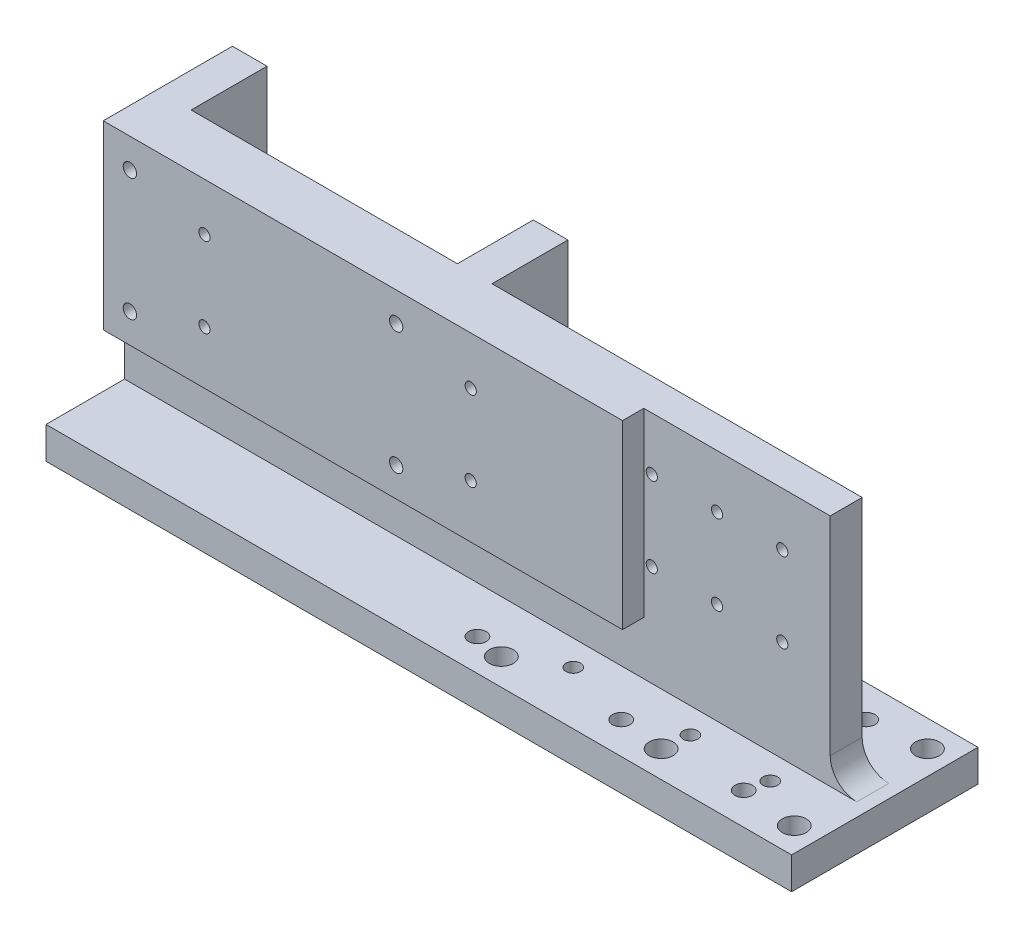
from build123d import *

# Parameters (mm, degrees)
SKETCH1_W                 = 280
SKETCH1_H                 = 70
BOSS_EXTRUDE1_DEPTH       = 12
BOSS_EXTRUDE2_DEPTH       = 88
FILLET2_R                 = 12.7
SKETCH3_W                 = 70
SKETCH3_H                 = 88
CUT_EXTRUDE1_DEPTH        = 8
SKETCH4_W                 = 195
SKETCH4_H                 = 20
CUT_EXTRUDE2_DEPTH        = 8
FILLET1_R                 = 10
M8_CLEARANCE_HOLE1_D      = 9
M6_CLEARANCE_HOLE1_D      = 6.6
M5_CLEARANCE_HOLE1_D      = 5.5
M5_CLEARANCE_HOLE1_DEPTH  = 12
M6X1_0_TAPPED_HOLE1_D     = 5
M6X1_0_TAPPED_HOLE1_DEPTH = 17
M6X1_0_TAPPED_HOLE1_TIP   = 1.502151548
M5X0_8_TAPPED_HOLE1_D     = 4.2
M5X0_8_TAPPED_HOLE2_D     = 4.2
M5X0_8_TAPPED_HOLE2_DEPTH = 14
M5X0_8_TAPPED_HOLE2_TIP   = 1.2618073


with BuildPart() as part:
    # Sketch1 → Boss-Extrude1 (new body)
    with BuildSketch(Plane(origin=(0, 0, 0), x_dir=(1, 0, 0), z_dir=(0, 1, 0))):
        Rectangle(SKETCH1_W, SKETCH1_H)
    extrude(amount=BOSS_EXTRUDE1_DEPTH)

    # Sketch2 → Boss-Extrude2 (add)
    with BuildSketch(Plane(origin=(0, 12, 0), x_dir=(1, 0, 0), z_dir=(0, 1, 0))):
        Polygon((-140, 35), (-140, -13.5), (125, -13.5), (125, 6.5), (-14, 6.5), (-14, 35), (-27, 35), (-27, 6.5), (-127, 6.5), (-127, 35), align=None)
    extrude(amount=BOSS_EXTRUDE2_DEPTH)

    # Fillet2
    fillet2_edges = [part.edges().sort_by_distance(p)[0] for p in [
        (-14, 12, -20.75),
        (-27, 12, -20.75),
        (-127, 12, -20.75),
    ]]
    fillet(fillet2_edges, radius=FILLET2_R)

    # Sketch3 → Cut-Extrude1 (cut)
    with BuildSketch(Plane.XY.offset(13.5)):
        with Locations((90, 56)):
            Rectangle(SKETCH3_W, SKETCH3_H)
    extrude(amount=-CUT_EXTRUDE1_DEPTH, mode=Mode.SUBTRACT)

    # Sketch4 → Cut-Extrude2 (cut)
    with BuildSketch(Plane.XY.offset(13.5)):
        with Locations((-42.5, 22)):
            Rectangle(SKETCH4_W, SKETCH4_H)
    extrude(amount=-CUT_EXTRUDE2_DEPTH, mode=Mode.SUBTRACT)

    # Fillet1
    fillet1_edges = [part.edges().sort_by_distance(p)[0] for p in [
        (125, 12, -0.5),
    ]]
    fillet(fillet1_edges, radius=FILLET1_R)

    # M8 Clearance Hole1 (through all)
    with Locations(Plane(origin=(0, 12, 0), x_dir=(1, 0, 0), z_dir=(0, 1, 0))):
        with Locations((131, 25), (81, 25), (21, 25), (21, -25), (81, -25), (131, -25)):
            Hole(M8_CLEARANCE_HOLE1_D / 2)

    # M6 Clearance Hole1 (through all)
    with Locations(Plane(origin=(0, 12, 0), x_dir=(1, 0, 0), z_dir=(0, 1, 0))):
        with Locations((110, 23), (110, -23), (64, 23), (64, -23), (10, 23), (10, -23)):
            Hole(M6_CLEARANCE_HOLE1_D / 2)

    # M5 Clearance Hole1
    with Locations(Plane(origin=(0, 12, 0), x_dir=(1, 0, 0), z_dir=(0, 1, 0))):
        with Locations((112, 15), (112, -15), (82, 15), (82, -15), (38, 15), (38, -15)):
            Hole(M5_CLEARANCE_HOLE1_D / 2, depth=M5_CLEARANCE_HOLE1_DEPTH)

    # M6x1.0 Tapped Hole1
    with Locations(Plane.XY.offset(13.5)):
        with Locations((-130, 89), (-130, 43), (-30, 89), (-30, 43)):
            Hole(M6X1_0_TAPPED_HOLE1_D / 2, depth=M6X1_0_TAPPED_HOLE1_DEPTH)
            with Locations((0, 0, -(M6X1_0_TAPPED_HOLE1_DEPTH + M6X1_0_TAPPED_HOLE1_TIP / 2))):  # 118° drill point
                Cone(0, M6X1_0_TAPPED_HOLE1_D / 2, M6X1_0_TAPPED_HOLE1_TIP, mode=Mode.SUBTRACT)

    # M5x0.8 Tapped Hole1 (through all)
    with Locations(Plane.XY.offset(5.5)):
        with Locations((107, 80), (82.5, 80), (58, 80), (58, 50), (82.5, 50), (107, 50)):
            Hole(M5X0_8_TAPPED_HOLE1_D / 2)

    # M5x0.8 Tapped Hole2
    with Locations(Plane.XY.offset(13.5)):
        with Locations((-102, 82), (-102, 52), (-2, 82), (-2, 52)):
            Hole(M5X0_8_TAPPED_HOLE2_D / 2, depth=M5X0_8_TAPPED_HOLE2_DEPTH)
            with Locations((0, 0, -(M5X0_8_TAPPED_HOLE2_DEPTH + M5X0_8_TAPPED_HOLE2_TIP / 2))):  # 118° drill point
                Cone(0, M5X0_8_TAPPED_HOLE2_D / 2, M5X0_8_TAPPED_HOLE2_TIP, mode=Mode.SUBTRACT)


solid = part.part
